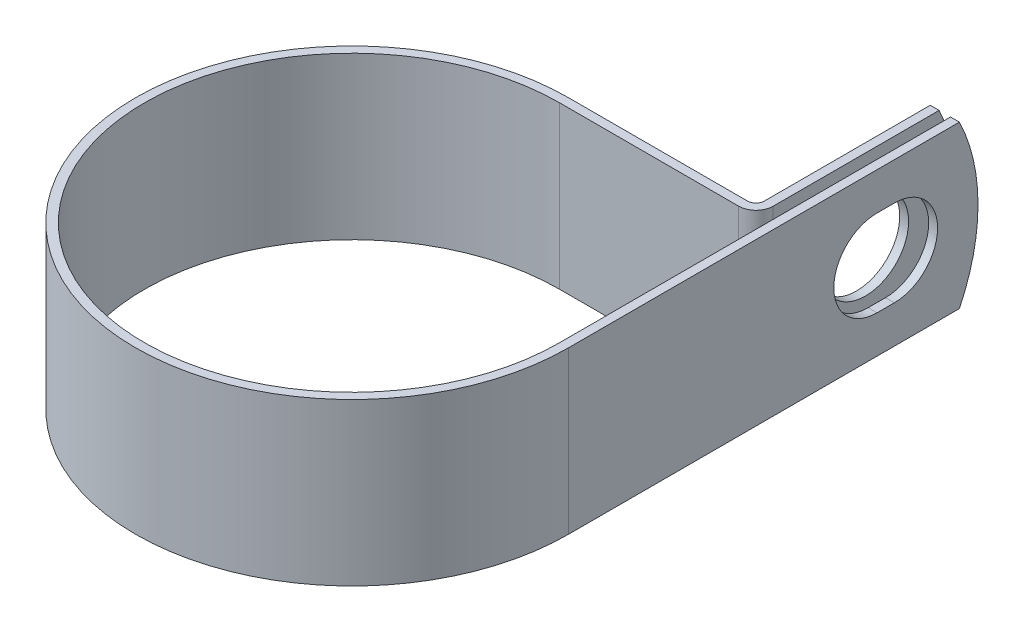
ISO-10303-21;
HEADER;
FILE_DESCRIPTION(('STEP AP214'),'2;1');
FILE_NAME('part.step','',(''),(''),'','','');
FILE_SCHEMA(('AUTOMOTIVE_DESIGN { 1 0 10303 214 1 1 1 1 }'));
ENDSEC;
DATA;
#1=APPLICATION_CONTEXT('core data for automotive mechanical design processes');
#2=APPLICATION_PROTOCOL_DEFINITION('international standard','automotive_design',2000,#1);
#3=PRODUCT_CONTEXT('',#1,'mechanical');
#4=PRODUCT('Part','Part','',(#3));
#5=PRODUCT_RELATED_PRODUCT_CATEGORY('part','',(#4));
#6=PRODUCT_DEFINITION_FORMATION('','',#4);
#7=PRODUCT_DEFINITION_CONTEXT('part definition',#1,'design');
#8=PRODUCT_DEFINITION('design','',#6,#7);
#9=PRODUCT_DEFINITION_SHAPE('','',#8);
#10=(LENGTH_UNIT() NAMED_UNIT(*) SI_UNIT(.MILLI.,.METRE.));
#11=(NAMED_UNIT(*) PLANE_ANGLE_UNIT() SI_UNIT($,.RADIAN.));
#12=(NAMED_UNIT(*) SI_UNIT($,.STERADIAN.) SOLID_ANGLE_UNIT());
#13=UNCERTAINTY_MEASURE_WITH_UNIT(LENGTH_MEASURE(1.E-05),#10,'distance_accuracy_value','');
#14=(GEOMETRIC_REPRESENTATION_CONTEXT(3) GLOBAL_UNCERTAINTY_ASSIGNED_CONTEXT((#13)) GLOBAL_UNIT_ASSIGNED_CONTEXT((#10,
#11,#12)) REPRESENTATION_CONTEXT('',''));
#15=CARTESIAN_POINT('',(0.,0.,0.));
#16=DIRECTION('',(0.,0.,1.));
#17=DIRECTION('',(1.,0.,0.));
#18=AXIS2_PLACEMENT_3D('',#15,#16,#17);
#19=CARTESIAN_POINT('',(28.575,11.1125,0.));
#20=DIRECTION('',(-1.,0.,0.));
#21=DIRECTION('',(0.,0.,1.));
#22=AXIS2_PLACEMENT_3D('',#19,#20,#21);
#23=PLANE('',#22);
#24=DIRECTION('',(0.,0.,-1.));
#25=VECTOR('',#24,1.);
#26=CARTESIAN_POINT('',(28.575,-5.9436,-42.4433999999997));
#27=LINE('',#26,#25);
#28=CARTESIAN_POINT('',(28.575,-5.9436,-42.4433999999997));
#29=VERTEX_POINT('',#28);
#30=CARTESIAN_POINT('',(28.575,-5.9436,-44.8310000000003));
#31=VERTEX_POINT('',#30);
#32=EDGE_CURVE('E236',#29,#31,#27,.T.);
#33=ORIENTED_EDGE('',*,*,#32,.T.);
#34=CARTESIAN_POINT('',(28.575,0.,-44.8309999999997));
#35=DIRECTION('',(-1.,0.,0.));
#36=DIRECTION('',(0.,0.,1.));
#37=AXIS2_PLACEMENT_3D('',#34,#35,#36);
#38=CIRCLE('',#37,5.9436);
#39=CARTESIAN_POINT('',(28.575,5.9436,-44.8310000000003));
#40=VERTEX_POINT('',#39);
#41=EDGE_CURVE('E257',#31,#40,#38,.F.);
#42=ORIENTED_EDGE('',*,*,#41,.T.);
#43=DIRECTION('',(0.,0.,1.));
#44=VECTOR('',#43,1.);
#45=CARTESIAN_POINT('',(28.575,5.9436,-42.4433999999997));
#46=LINE('',#45,#44);
#47=CARTESIAN_POINT('',(28.575,5.9436,-42.4433999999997));
#48=VERTEX_POINT('',#47);
#49=EDGE_CURVE('E253',#40,#48,#46,.T.);
#50=ORIENTED_EDGE('',*,*,#49,.T.);
#51=CARTESIAN_POINT('',(28.575,0.,-42.4433999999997));
#52=DIRECTION('',(-1.,0.,0.));
#53=DIRECTION('',(0.,0.,1.));
#54=AXIS2_PLACEMENT_3D('',#51,#52,#53);
#55=CIRCLE('',#54,5.9436);
#56=EDGE_CURVE('E248',#48,#29,#55,.F.);
#57=ORIENTED_EDGE('',*,*,#56,.T.);
#58=EDGE_LOOP('',(#33,#42,#50,#57));
#59=FACE_BOUND('',#58,.T.);
#60=CARTESIAN_POINT('',(28.575,0.,-30.9372));
#61=DIRECTION('',(-1.,0.,0.));
#62=DIRECTION('',(0.,0.,1.));
#63=AXIS2_PLACEMENT_3D('',#60,#61,#62);
#64=CIRCLE('',#63,25.4);
#65=CARTESIAN_POINT('',(28.575,11.1125,-53.7773476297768));
#66=VERTEX_POINT('',#65);
#67=CARTESIAN_POINT('',(28.575,-11.1125,-53.7773476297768));
#68=VERTEX_POINT('',#67);
#69=EDGE_CURVE('E75',#66,#68,#64,.T.);
#70=ORIENTED_EDGE('',*,*,#69,.T.);
#71=DIRECTION('',(0.,0.,-1.));
#72=VECTOR('',#71,1.);
#73=CARTESIAN_POINT('',(28.575,-11.1125,0.));
#74=LINE('',#73,#72);
#75=CARTESIAN_POINT('',(28.575,-11.1125,0.));
#76=VERTEX_POINT('',#75);
#77=EDGE_CURVE('E271',#76,#68,#74,.T.);
#78=ORIENTED_EDGE('',*,*,#77,.F.);
#79=DIRECTION('',(0.,-1.,0.));
#80=VECTOR('',#79,1.);
#81=CARTESIAN_POINT('',(28.575,11.1125,0.));
#82=LINE('',#81,#80);
#83=CARTESIAN_POINT('',(28.575,11.1125,0.));
#84=VERTEX_POINT('',#83);
#85=EDGE_CURVE('E218',#84,#76,#82,.T.);
#86=ORIENTED_EDGE('',*,*,#85,.F.);
#87=DIRECTION('',(0.,0.,-1.));
#88=VECTOR('',#87,1.);
#89=CARTESIAN_POINT('',(28.575,11.1125,-28.575));
#90=LINE('',#89,#88);
#91=EDGE_CURVE('E273',#84,#66,#90,.T.);
#92=ORIENTED_EDGE('',*,*,#91,.T.);
#93=EDGE_LOOP('',(#70,#78,#86,#92));
#94=FACE_BOUND('',#93,.T.);
#95=ADVANCED_FACE('F54',(#59,#94),#23,.T.);
#96=CARTESIAN_POINT('',(27.0002,11.1125,-56.3372));
#97=DIRECTION('',(1.,0.,0.));
#98=DIRECTION('',(0.,0.,-1.));
#99=AXIS2_PLACEMENT_3D('',#96,#97,#98);
#100=PLANE('',#99);
#101=CARTESIAN_POINT('',(27.0002,0.,-43.6372));
#102=DIRECTION('',(1.,0.,0.));
#103=DIRECTION('',(0.,0.,-1.));
#104=AXIS2_PLACEMENT_3D('',#101,#102,#103);
#105=CIRCLE('',#104,5.9436);
#106=CARTESIAN_POINT('',(27.0002,0.,-49.5808));
#107=VERTEX_POINT('',#106);
#108=EDGE_CURVE('E268',#107,#107,#105,.F.);
#109=ORIENTED_EDGE('',*,*,#108,.T.);
#110=EDGE_LOOP('',(#109));
#111=FACE_BOUND('',#110,.T.);
#112=DIRECTION('',(0.,0.,1.));
#113=VECTOR('',#112,1.);
#114=CARTESIAN_POINT('',(27.0002,-11.1125,-56.3372));
#115=LINE('',#114,#113);
#116=CARTESIAN_POINT('',(27.0002,-11.1125,-53.7773476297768));
#117=VERTEX_POINT('',#116);
#118=CARTESIAN_POINT('',(27.0002,-11.1125,-30.95244));
#119=VERTEX_POINT('',#118);
#120=EDGE_CURVE('E184',#117,#119,#115,.T.);
#121=ORIENTED_EDGE('',*,*,#120,.F.);
#122=CARTESIAN_POINT('',(27.0002,0.,-30.9372));
#123=DIRECTION('',(1.,0.,0.));
#124=DIRECTION('',(0.,0.,-1.));
#125=AXIS2_PLACEMENT_3D('',#122,#123,#124);
#126=CIRCLE('',#125,25.4);
#127=CARTESIAN_POINT('',(27.0002,11.1125,-53.7773476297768));
#128=VERTEX_POINT('',#127);
#129=EDGE_CURVE('E176',#117,#128,#126,.T.);
#130=ORIENTED_EDGE('',*,*,#129,.T.);
#131=DIRECTION('',(0.,0.,1.));
#132=VECTOR('',#131,1.);
#133=CARTESIAN_POINT('',(27.0002,11.1125,-56.3372));
#134=LINE('',#133,#132);
#135=CARTESIAN_POINT('',(27.0002,11.1125,-30.95244));
#136=VERTEX_POINT('',#135);
#137=EDGE_CURVE('E224',#128,#136,#134,.T.);
#138=ORIENTED_EDGE('',*,*,#137,.T.);
#139=DIRECTION('',(0.,-1.,0.));
#140=VECTOR('',#139,1.);
#141=CARTESIAN_POINT('',(27.0002,11.1125,-30.95244));
#142=LINE('',#141,#140);
#143=EDGE_CURVE('E211',#136,#119,#142,.T.);
#144=ORIENTED_EDGE('',*,*,#143,.T.);
#145=EDGE_LOOP('',(#121,#130,#138,#144));
#146=FACE_BOUND('',#145,.T.);
#147=ADVANCED_FACE('F226',(#111,#146),#100,.T.);
#148=CARTESIAN_POINT('',(25.781,11.1125,-56.3372));
#149=DIRECTION('',(1.,0.,0.));
#150=DIRECTION('',(0.,0.,-1.));
#151=AXIS2_PLACEMENT_3D('',#148,#149,#150);
#152=PLANE('',#151);
#153=CARTESIAN_POINT('',(25.781,0.,-43.6372));
#154=DIRECTION('',(-1.,0.,0.));
#155=DIRECTION('',(0.,0.,1.));
#156=AXIS2_PLACEMENT_3D('',#153,#154,#155);
#157=CIRCLE('',#156,5.9436);
#158=CARTESIAN_POINT('',(25.781,0.,-37.6936));
#159=VERTEX_POINT('',#158);
#160=EDGE_CURVE('E265',#159,#159,#157,.T.);
#161=ORIENTED_EDGE('',*,*,#160,.F.);
#162=EDGE_LOOP('',(#161));
#163=FACE_BOUND('',#162,.T.);
#164=CARTESIAN_POINT('',(25.781,0.,-30.9372));
#165=DIRECTION('',(-1.,0.,0.));
#166=DIRECTION('',(0.,0.,1.));
#167=AXIS2_PLACEMENT_3D('',#164,#165,#166);
#168=CIRCLE('',#167,25.4);
#169=CARTESIAN_POINT('',(25.781,11.1125,-53.7773476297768));
#170=VERTEX_POINT('',#169);
#171=CARTESIAN_POINT('',(25.781,-11.1125,-53.7773476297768));
#172=VERTEX_POINT('',#171);
#173=EDGE_CURVE('E67',#170,#172,#168,.T.);
#174=ORIENTED_EDGE('',*,*,#173,.T.);
#175=DIRECTION('',(0.,0.,1.));
#176=VECTOR('',#175,1.);
#177=CARTESIAN_POINT('',(25.781,-11.1125,-56.3372));
#178=LINE('',#177,#176);
#179=CARTESIAN_POINT('',(25.781,-11.1125,-30.95244));
#180=VERTEX_POINT('',#179);
#181=EDGE_CURVE('E167',#172,#180,#178,.T.);
#182=ORIENTED_EDGE('',*,*,#181,.T.);
#183=DIRECTION('',(0.,-1.,0.));
#184=VECTOR('',#183,1.);
#185=CARTESIAN_POINT('',(25.781,11.1125,-30.95244));
#186=LINE('',#185,#184);
#187=CARTESIAN_POINT('',(25.781,11.1125,-30.95244));
#188=VERTEX_POINT('',#187);
#189=EDGE_CURVE('E209',#188,#180,#186,.T.);
#190=ORIENTED_EDGE('',*,*,#189,.F.);
#191=DIRECTION('',(0.,0.,1.));
#192=VECTOR('',#191,1.);
#193=CARTESIAN_POINT('',(25.781,11.1125,-56.3372));
#194=LINE('',#193,#192);
#195=EDGE_CURVE('E169',#170,#188,#194,.T.);
#196=ORIENTED_EDGE('',*,*,#195,.F.);
#197=EDGE_LOOP('',(#174,#182,#190,#196));
#198=FACE_BOUND('',#197,.T.);
#199=ADVANCED_FACE('F164',(#163,#198),#152,.F.);
#200=CARTESIAN_POINT('',(29.7942,11.1125,0.));
#201=DIRECTION('',(-1.,0.,0.));
#202=DIRECTION('',(0.,0.,1.));
#203=AXIS2_PLACEMENT_3D('',#200,#201,#202);
#204=PLANE('',#203);
#205=CARTESIAN_POINT('',(29.7942,0.,-44.8309999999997));
#206=DIRECTION('',(1.,0.,0.));
#207=DIRECTION('',(0.,0.,-1.));
#208=AXIS2_PLACEMENT_3D('',#205,#206,#207);
#209=CIRCLE('',#208,5.9436);
#210=CARTESIAN_POINT('',(29.7942,-5.9436,-44.8310000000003));
#211=VERTEX_POINT('',#210);
#212=CARTESIAN_POINT('',(29.7942,5.9436,-44.8310000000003));
#213=VERTEX_POINT('',#212);
#214=EDGE_CURVE('E237',#211,#213,#209,.T.);
#215=ORIENTED_EDGE('',*,*,#214,.F.);
#216=DIRECTION('',(0.,0.,-1.));
#217=VECTOR('',#216,1.);
#218=CARTESIAN_POINT('',(29.7942,-5.9436,-42.4433999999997));
#219=LINE('',#218,#217);
#220=CARTESIAN_POINT('',(29.7942,-5.9436,-42.4433999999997));
#221=VERTEX_POINT('',#220);
#222=EDGE_CURVE('E240',#221,#211,#219,.T.);
#223=ORIENTED_EDGE('',*,*,#222,.F.);
#224=CARTESIAN_POINT('',(29.7942,0.,-42.4433999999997));
#225=DIRECTION('',(1.,0.,0.));
#226=DIRECTION('',(0.,0.,-1.));
#227=AXIS2_PLACEMENT_3D('',#224,#225,#226);
#228=CIRCLE('',#227,5.9436);
#229=CARTESIAN_POINT('',(29.7942,5.9436,-42.4433999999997));
#230=VERTEX_POINT('',#229);
#231=EDGE_CURVE('E230',#230,#221,#228,.T.);
#232=ORIENTED_EDGE('',*,*,#231,.F.);
#233=DIRECTION('',(0.,0.,1.));
#234=VECTOR('',#233,1.);
#235=CARTESIAN_POINT('',(29.7942,5.9436,-42.4433999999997));
#236=LINE('',#235,#234);
#237=EDGE_CURVE('E234',#213,#230,#236,.T.);
#238=ORIENTED_EDGE('',*,*,#237,.F.);
#239=EDGE_LOOP('',(#215,#223,#232,#238));
#240=FACE_BOUND('',#239,.T.);
#241=DIRECTION('',(0.,0.,-1.));
#242=VECTOR('',#241,1.);
#243=CARTESIAN_POINT('',(29.7942,-11.1125,0.));
#244=LINE('',#243,#242);
#245=CARTESIAN_POINT('',(29.7942,-11.1125,0.));
#246=VERTEX_POINT('',#245);
#247=CARTESIAN_POINT('',(29.7942,-11.1125,-53.7773476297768));
#248=VERTEX_POINT('',#247);
#249=EDGE_CURVE('E195',#246,#248,#244,.T.);
#250=ORIENTED_EDGE('',*,*,#249,.T.);
#251=CARTESIAN_POINT('',(29.7942,0.,-30.9372));
#252=DIRECTION('',(-1.,0.,0.));
#253=DIRECTION('',(0.,0.,1.));
#254=AXIS2_PLACEMENT_3D('',#251,#252,#253);
#255=CIRCLE('',#254,25.4);
#256=CARTESIAN_POINT('',(29.7942,11.1125,-53.7773476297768));
#257=VERTEX_POINT('',#256);
#258=EDGE_CURVE('E170',#257,#248,#255,.T.);
#259=ORIENTED_EDGE('',*,*,#258,.F.);
#260=DIRECTION('',(0.,0.,-1.));
#261=VECTOR('',#260,1.);
#262=CARTESIAN_POINT('',(29.7942,11.1125,-28.575));
#263=LINE('',#262,#261);
#264=CARTESIAN_POINT('',(29.7942,11.1125,0.));
#265=VERTEX_POINT('',#264);
#266=EDGE_CURVE('E198',#265,#257,#263,.T.);
#267=ORIENTED_EDGE('',*,*,#266,.F.);
#268=DIRECTION('',(0.,-1.,0.));
#269=VECTOR('',#268,1.);
#270=CARTESIAN_POINT('',(29.7942,11.1125,0.));
#271=LINE('',#270,#269);
#272=EDGE_CURVE('E199',#265,#246,#271,.T.);
#273=ORIENTED_EDGE('',*,*,#272,.T.);
#274=EDGE_LOOP('',(#250,#259,#267,#273));
#275=FACE_BOUND('',#274,.T.);
#276=ADVANCED_FACE('F321',(#240,#275),#204,.F.);
#277=CARTESIAN_POINT('',(0.,-11.1125,0.));
#278=DIRECTION('',(0.,1.,0.));
#279=DIRECTION('',(1.,0.,0.));
#280=AXIS2_PLACEMENT_3D('',#277,#278,#279);
#281=PLANE('',#280);
#282=DIRECTION('',(-1.,0.,0.));
#283=VECTOR('',#282,1.);
#284=CARTESIAN_POINT('',(29.7942,-11.1125,-53.7773476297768));
#285=LINE('',#284,#283);
#286=EDGE_CURVE('E171',#248,#68,#285,.T.);
#287=ORIENTED_EDGE('',*,*,#286,.F.);
#288=ORIENTED_EDGE('',*,*,#249,.F.);
#289=CARTESIAN_POINT('',(0.,-11.1125,0.));
#290=DIRECTION('',(0.,1.,0.));
#291=DIRECTION('',(1.,0.,0.));
#292=AXIS2_PLACEMENT_3D('',#289,#290,#291);
#293=CIRCLE('',#292,29.7942);
#294=CARTESIAN_POINT('',(0.,-11.1125,-29.7942));
#295=VERTEX_POINT('',#294);
#296=EDGE_CURVE('E193',#295,#246,#293,.T.);
#297=ORIENTED_EDGE('',*,*,#296,.F.);
#298=DIRECTION('',(1.,0.,0.));
#299=VECTOR('',#298,1.);
#300=CARTESIAN_POINT('',(0.,-11.1125,-29.7942));
#301=LINE('',#300,#299);
#302=CARTESIAN_POINT('',(24.62276,-11.1125,-29.7942));
#303=VERTEX_POINT('',#302);
#304=EDGE_CURVE('E186',#303,#295,#301,.F.);
#305=ORIENTED_EDGE('',*,*,#304,.F.);
#306=CARTESIAN_POINT('',(24.62276,-11.1125,-30.95244));
#307=DIRECTION('',(0.,1.,0.));
#308=DIRECTION('',(1.,0.,0.));
#309=AXIS2_PLACEMENT_3D('',#306,#307,#308);
#310=CIRCLE('',#309,1.15824);
#311=EDGE_CURVE('E183',#180,#303,#310,.F.);
#312=ORIENTED_EDGE('',*,*,#311,.F.);
#313=ORIENTED_EDGE('',*,*,#181,.F.);
#314=DIRECTION('',(-1.,0.,0.));
#315=VECTOR('',#314,1.);
#316=CARTESIAN_POINT('',(29.7942,-11.1125,-53.7773476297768));
#317=LINE('',#316,#315);
#318=EDGE_CURVE('E12',#117,#172,#317,.T.);
#319=ORIENTED_EDGE('',*,*,#318,.F.);
#320=ORIENTED_EDGE('',*,*,#120,.T.);
#321=CARTESIAN_POINT('',(24.62276,-11.1125,-30.95244));
#322=DIRECTION('',(0.,-1.,0.));
#323=DIRECTION('',(0.,0.,1.));
#324=AXIS2_PLACEMENT_3D('',#321,#322,#323);
#325=CIRCLE('',#324,2.37744);
#326=CARTESIAN_POINT('',(24.62276,-11.1125,-28.575));
#327=VERTEX_POINT('',#326);
#328=EDGE_CURVE('E188',#119,#327,#325,.T.);
#329=ORIENTED_EDGE('',*,*,#328,.T.);
#330=DIRECTION('',(-1.,0.,0.));
#331=VECTOR('',#330,1.);
#332=CARTESIAN_POINT('',(0.,-11.1125,-28.575));
#333=LINE('',#332,#331);
#334=CARTESIAN_POINT('',(0.,-11.1125,-28.575));
#335=VERTEX_POINT('',#334);
#336=EDGE_CURVE('E298',#327,#335,#333,.T.);
#337=ORIENTED_EDGE('',*,*,#336,.T.);
#338=CARTESIAN_POINT('',(0.,-11.1125,0.));
#339=DIRECTION('',(0.,1.,0.));
#340=DIRECTION('',(0.,0.,1.));
#341=AXIS2_PLACEMENT_3D('',#338,#339,#340);
#342=CIRCLE('',#341,28.575);
#343=EDGE_CURVE('E295',#335,#76,#342,.T.);
#344=ORIENTED_EDGE('',*,*,#343,.T.);
#345=ORIENTED_EDGE('',*,*,#77,.T.);
#346=EDGE_LOOP('',(#287,#288,#297,#305,#312,#313,#319,#320,#329,#337,#344,#345));
#347=FACE_BOUND('',#346,.T.);
#348=ADVANCED_FACE('F181',(#347),#281,.F.);
#349=CARTESIAN_POINT('',(0.,11.1125,0.));
#350=DIRECTION('',(0.,1.,0.));
#351=DIRECTION('',(1.,0.,0.));
#352=AXIS2_PLACEMENT_3D('',#349,#350,#351);
#353=PLANE('',#352);
#354=ORIENTED_EDGE('',*,*,#266,.T.);
#355=DIRECTION('',(-1.,0.,0.));
#356=VECTOR('',#355,1.);
#357=CARTESIAN_POINT('',(29.7942,11.1125,-53.7773476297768));
#358=LINE('',#357,#356);
#359=EDGE_CURVE('E228',#257,#66,#358,.T.);
#360=ORIENTED_EDGE('',*,*,#359,.T.);
#361=ORIENTED_EDGE('',*,*,#91,.F.);
#362=CARTESIAN_POINT('',(0.,11.1125,0.));
#363=DIRECTION('',(0.,1.,0.));
#364=DIRECTION('',(0.,0.,1.));
#365=AXIS2_PLACEMENT_3D('',#362,#363,#364);
#366=CIRCLE('',#365,28.575);
#367=CARTESIAN_POINT('',(0.,11.1125,-28.575));
#368=VERTEX_POINT('',#367);
#369=EDGE_CURVE('E276',#368,#84,#366,.T.);
#370=ORIENTED_EDGE('',*,*,#369,.F.);
#371=DIRECTION('',(-1.,0.,0.));
#372=VECTOR('',#371,1.);
#373=CARTESIAN_POINT('',(0.,11.1125,-28.575));
#374=LINE('',#373,#372);
#375=CARTESIAN_POINT('',(24.62276,11.1125,-28.575));
#376=VERTEX_POINT('',#375);
#377=EDGE_CURVE('E279',#376,#368,#374,.T.);
#378=ORIENTED_EDGE('',*,*,#377,.F.);
#379=CARTESIAN_POINT('',(24.62276,11.1125,-30.95244));
#380=DIRECTION('',(0.,-1.,0.));
#381=DIRECTION('',(0.,0.,1.));
#382=AXIS2_PLACEMENT_3D('',#379,#380,#381);
#383=CIRCLE('',#382,2.37744);
#384=EDGE_CURVE('E282',#136,#376,#383,.T.);
#385=ORIENTED_EDGE('',*,*,#384,.F.);
#386=ORIENTED_EDGE('',*,*,#137,.F.);
#387=DIRECTION('',(-1.,0.,0.));
#388=VECTOR('',#387,1.);
#389=CARTESIAN_POINT('',(29.7942,11.1125,-53.7773476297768));
#390=LINE('',#389,#388);
#391=EDGE_CURVE('E61',#128,#170,#390,.T.);
#392=ORIENTED_EDGE('',*,*,#391,.T.);
#393=ORIENTED_EDGE('',*,*,#195,.T.);
#394=CARTESIAN_POINT('',(24.62276,11.1125,-30.95244));
#395=DIRECTION('',(0.,1.,0.));
#396=DIRECTION('',(1.,0.,0.));
#397=AXIS2_PLACEMENT_3D('',#394,#395,#396);
#398=CIRCLE('',#397,1.15824);
#399=CARTESIAN_POINT('',(24.62276,11.1125,-29.7942));
#400=VERTEX_POINT('',#399);
#401=EDGE_CURVE('E287',#188,#400,#398,.F.);
#402=ORIENTED_EDGE('',*,*,#401,.T.);
#403=DIRECTION('',(1.,0.,0.));
#404=VECTOR('',#403,1.);
#405=CARTESIAN_POINT('',(0.,11.1125,-29.7942));
#406=LINE('',#405,#404);
#407=CARTESIAN_POINT('',(0.,11.1125,-29.7942));
#408=VERTEX_POINT('',#407);
#409=EDGE_CURVE('E289',#400,#408,#406,.F.);
#410=ORIENTED_EDGE('',*,*,#409,.T.);
#411=CARTESIAN_POINT('',(0.,11.1125,0.));
#412=DIRECTION('',(0.,1.,0.));
#413=DIRECTION('',(1.,0.,0.));
#414=AXIS2_PLACEMENT_3D('',#411,#412,#413);
#415=CIRCLE('',#414,29.7942);
#416=EDGE_CURVE('E203',#408,#265,#415,.T.);
#417=ORIENTED_EDGE('',*,*,#416,.T.);
#418=EDGE_LOOP('',(#354,#360,#361,#370,#378,#385,#386,#392,#393,#402,#410,#417));
#419=FACE_BOUND('',#418,.T.);
#420=ADVANCED_FACE('F222',(#419),#353,.T.);
#421=CARTESIAN_POINT('',(0.,11.1125,0.));
#422=DIRECTION('',(0.,-1.,0.));
#423=DIRECTION('',(0.,0.,-1.));
#424=AXIS2_PLACEMENT_3D('',#421,#422,#423);
#425=CYLINDRICAL_SURFACE('',#424,28.575);
#426=ORIENTED_EDGE('',*,*,#343,.F.);
#427=DIRECTION('',(0.,-1.,0.));
#428=VECTOR('',#427,1.);
#429=CARTESIAN_POINT('',(0.,11.1125,-28.575));
#430=LINE('',#429,#428);
#431=EDGE_CURVE('E216',#368,#335,#430,.T.);
#432=ORIENTED_EDGE('',*,*,#431,.F.);
#433=ORIENTED_EDGE('',*,*,#369,.T.);
#434=ORIENTED_EDGE('',*,*,#85,.T.);
#435=EDGE_LOOP('',(#426,#432,#433,#434));
#436=FACE_BOUND('',#435,.T.);
#437=ADVANCED_FACE('F311',(#436),#425,.F.);
#438=CARTESIAN_POINT('',(0.,11.1125,-28.575));
#439=DIRECTION('',(0.,0.,1.));
#440=DIRECTION('',(1.,0.,0.));
#441=AXIS2_PLACEMENT_3D('',#438,#439,#440);
#442=PLANE('',#441);
#443=ORIENTED_EDGE('',*,*,#336,.F.);
#444=DIRECTION('',(0.,-1.,0.));
#445=VECTOR('',#444,1.);
#446=CARTESIAN_POINT('',(24.62276,11.1125,-28.575));
#447=LINE('',#446,#445);
#448=EDGE_CURVE('E214',#376,#327,#447,.T.);
#449=ORIENTED_EDGE('',*,*,#448,.F.);
#450=ORIENTED_EDGE('',*,*,#377,.T.);
#451=ORIENTED_EDGE('',*,*,#431,.T.);
#452=EDGE_LOOP('',(#443,#449,#450,#451));
#453=FACE_BOUND('',#452,.T.);
#454=ADVANCED_FACE('F307',(#453),#442,.T.);
#455=CARTESIAN_POINT('',(24.62276,11.1125,-30.95244));
#456=DIRECTION('',(0.,-1.,0.));
#457=DIRECTION('',(0.,0.,-1.));
#458=AXIS2_PLACEMENT_3D('',#455,#456,#457);
#459=CYLINDRICAL_SURFACE('',#458,2.37744);
#460=ORIENTED_EDGE('',*,*,#328,.F.);
#461=ORIENTED_EDGE('',*,*,#143,.F.);
#462=ORIENTED_EDGE('',*,*,#384,.T.);
#463=ORIENTED_EDGE('',*,*,#448,.T.);
#464=EDGE_LOOP('',(#460,#461,#462,#463));
#465=FACE_BOUND('',#464,.T.);
#466=ADVANCED_FACE('F304',(#465),#459,.T.);
#467=CARTESIAN_POINT('',(24.62276,11.1125,-30.95244));
#468=DIRECTION('',(0.,-1.,0.));
#469=DIRECTION('',(0.,0.,-1.));
#470=AXIS2_PLACEMENT_3D('',#467,#468,#469);
#471=CYLINDRICAL_SURFACE('',#470,1.15824);
#472=ORIENTED_EDGE('',*,*,#311,.T.);
#473=DIRECTION('',(0.,-1.,0.));
#474=VECTOR('',#473,1.);
#475=CARTESIAN_POINT('',(24.62276,11.1125,-29.7942));
#476=LINE('',#475,#474);
#477=EDGE_CURVE('E206',#400,#303,#476,.T.);
#478=ORIENTED_EDGE('',*,*,#477,.F.);
#479=ORIENTED_EDGE('',*,*,#401,.F.);
#480=ORIENTED_EDGE('',*,*,#189,.T.);
#481=EDGE_LOOP('',(#472,#478,#479,#480));
#482=FACE_BOUND('',#481,.T.);
#483=ADVANCED_FACE('F334',(#482),#471,.F.);
#484=CARTESIAN_POINT('',(0.,11.1125,-29.7942));
#485=DIRECTION('',(0.,0.,1.));
#486=DIRECTION('',(1.,0.,0.));
#487=AXIS2_PLACEMENT_3D('',#484,#485,#486);
#488=PLANE('',#487);
#489=ORIENTED_EDGE('',*,*,#304,.T.);
#490=DIRECTION('',(0.,-1.,0.));
#491=VECTOR('',#490,1.);
#492=CARTESIAN_POINT('',(0.,11.1125,-29.7942));
#493=LINE('',#492,#491);
#494=EDGE_CURVE('E202',#408,#295,#493,.T.);
#495=ORIENTED_EDGE('',*,*,#494,.F.);
#496=ORIENTED_EDGE('',*,*,#409,.F.);
#497=ORIENTED_EDGE('',*,*,#477,.T.);
#498=EDGE_LOOP('',(#489,#495,#496,#497));
#499=FACE_BOUND('',#498,.T.);
#500=ADVANCED_FACE('F330',(#499),#488,.F.);
#501=CARTESIAN_POINT('',(0.,11.1125,0.));
#502=DIRECTION('',(0.,-1.,0.));
#503=DIRECTION('',(0.,0.,-1.));
#504=AXIS2_PLACEMENT_3D('',#501,#502,#503);
#505=CYLINDRICAL_SURFACE('',#504,29.7942);
#506=ORIENTED_EDGE('',*,*,#296,.T.);
#507=ORIENTED_EDGE('',*,*,#272,.F.);
#508=ORIENTED_EDGE('',*,*,#416,.F.);
#509=ORIENTED_EDGE('',*,*,#494,.T.);
#510=EDGE_LOOP('',(#506,#507,#508,#509));
#511=FACE_BOUND('',#510,.T.);
#512=ADVANCED_FACE('F327',(#511),#505,.T.);
#513=CARTESIAN_POINT('',(43.8112394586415,0.,-43.6372));
#514=DIRECTION('',(-1.,0.,0.));
#515=DIRECTION('',(0.,0.,1.));
#516=AXIS2_PLACEMENT_3D('',#513,#514,#515);
#517=CYLINDRICAL_SURFACE('',#516,5.9436);
#518=ORIENTED_EDGE('',*,*,#160,.T.);
#519=EDGE_LOOP('',(#518));
#520=FACE_BOUND('',#519,.T.);
#521=ORIENTED_EDGE('',*,*,#108,.F.);
#522=EDGE_LOOP('',(#521));
#523=FACE_BOUND('',#522,.T.);
#524=ADVANCED_FACE('F379',(#520,#523),#517,.F.);
#525=CARTESIAN_POINT('',(9.99879374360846,-5.9436,-42.4433999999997));
#526=DIRECTION('',(0.,-1.,0.));
#527=DIRECTION('',(0.,0.,-1.));
#528=AXIS2_PLACEMENT_3D('',#525,#526,#527);
#529=PLANE('',#528);
#530=DIRECTION('',(1.,0.,0.));
#531=VECTOR('',#530,1.);
#532=CARTESIAN_POINT('',(9.99879374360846,-5.9436,-42.4433999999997));
#533=LINE('',#532,#531);
#534=EDGE_CURVE('E251',#29,#221,#533,.T.);
#535=ORIENTED_EDGE('',*,*,#534,.T.);
#536=ORIENTED_EDGE('',*,*,#222,.T.);
#537=DIRECTION('',(1.,0.,0.));
#538=VECTOR('',#537,1.);
#539=CARTESIAN_POINT('',(9.99879374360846,-5.9436,-44.8310000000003));
#540=LINE('',#539,#538);
#541=EDGE_CURVE('E247',#31,#211,#540,.T.);
#542=ORIENTED_EDGE('',*,*,#541,.F.);
#543=ORIENTED_EDGE('',*,*,#32,.F.);
#544=EDGE_LOOP('',(#535,#536,#542,#543));
#545=FACE_BOUND('',#544,.T.);
#546=ADVANCED_FACE('F354',(#545),#529,.F.);
#547=CARTESIAN_POINT('',(9.99879374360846,0.,-44.8309999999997));
#548=DIRECTION('',(1.,0.,0.));
#549=DIRECTION('',(0.,0.,-1.));
#550=AXIS2_PLACEMENT_3D('',#547,#548,#549);
#551=CYLINDRICAL_SURFACE('',#550,5.9436);
#552=ORIENTED_EDGE('',*,*,#541,.T.);
#553=ORIENTED_EDGE('',*,*,#214,.T.);
#554=DIRECTION('',(1.,0.,0.));
#555=VECTOR('',#554,1.);
#556=CARTESIAN_POINT('',(9.99879374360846,5.9436,-44.8310000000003));
#557=LINE('',#556,#555);
#558=EDGE_CURVE('E256',#40,#213,#557,.T.);
#559=ORIENTED_EDGE('',*,*,#558,.F.);
#560=ORIENTED_EDGE('',*,*,#41,.F.);
#561=EDGE_LOOP('',(#552,#553,#559,#560));
#562=FACE_BOUND('',#561,.T.);
#563=ADVANCED_FACE('F358',(#562),#551,.F.);
#564=CARTESIAN_POINT('',(9.99879374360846,5.9436,-42.4433999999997));
#565=DIRECTION('',(0.,1.,0.));
#566=DIRECTION('',(0.,0.,1.));
#567=AXIS2_PLACEMENT_3D('',#564,#565,#566);
#568=PLANE('',#567);
#569=ORIENTED_EDGE('',*,*,#558,.T.);
#570=ORIENTED_EDGE('',*,*,#237,.T.);
#571=DIRECTION('',(1.,0.,0.));
#572=VECTOR('',#571,1.);
#573=CARTESIAN_POINT('',(9.99879374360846,5.9436,-42.4433999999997));
#574=LINE('',#573,#572);
#575=EDGE_CURVE('E252',#48,#230,#574,.T.);
#576=ORIENTED_EDGE('',*,*,#575,.F.);
#577=ORIENTED_EDGE('',*,*,#49,.F.);
#578=EDGE_LOOP('',(#569,#570,#576,#577));
#579=FACE_BOUND('',#578,.T.);
#580=ADVANCED_FACE('F362',(#579),#568,.F.);
#581=CARTESIAN_POINT('',(9.99879374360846,0.,-42.4433999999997));
#582=DIRECTION('',(1.,0.,0.));
#583=DIRECTION('',(0.,0.,-1.));
#584=AXIS2_PLACEMENT_3D('',#581,#582,#583);
#585=CYLINDRICAL_SURFACE('',#584,5.9436);
#586=ORIENTED_EDGE('',*,*,#575,.T.);
#587=ORIENTED_EDGE('',*,*,#231,.T.);
#588=ORIENTED_EDGE('',*,*,#534,.F.);
#589=ORIENTED_EDGE('',*,*,#56,.F.);
#590=EDGE_LOOP('',(#586,#587,#588,#589));
#591=FACE_BOUND('',#590,.T.);
#592=ADVANCED_FACE('F366',(#591),#585,.F.);
#593=CARTESIAN_POINT('',(29.7942,0.,-30.9372));
#594=DIRECTION('',(-1.,0.,0.));
#595=DIRECTION('',(0.,0.,1.));
#596=AXIS2_PLACEMENT_3D('',#593,#594,#595);
#597=CYLINDRICAL_SURFACE('',#596,25.4);
#598=ORIENTED_EDGE('',*,*,#129,.F.);
#599=ORIENTED_EDGE('',*,*,#318,.T.);
#600=ORIENTED_EDGE('',*,*,#173,.F.);
#601=ORIENTED_EDGE('',*,*,#391,.F.);
#602=EDGE_LOOP('',(#598,#599,#600,#601));
#603=FACE_BOUND('',#602,.T.);
#604=ADVANCED_FACE('F174',(#603),#597,.T.);
#605=ORIENTED_EDGE('',*,*,#359,.F.);
#606=ORIENTED_EDGE('',*,*,#258,.T.);
#607=ORIENTED_EDGE('',*,*,#286,.T.);
#608=ORIENTED_EDGE('',*,*,#69,.F.);
#609=EDGE_LOOP('',(#605,#606,#607,#608));
#610=FACE_BOUND('',#609,.T.);
#611=ADVANCED_FACE('F316',(#610),#597,.T.);
#612=CLOSED_SHELL('',(#95,#147,#199,#276,#348,#420,#437,#454,#466,#483,#500,#512,#524,#546,#563,
#580,#592,#604,#611));
#613=MANIFOLD_SOLID_BREP('B2',#612);
#614=ADVANCED_BREP_SHAPE_REPRESENTATION('',(#18,#613),#14);
#615=SHAPE_DEFINITION_REPRESENTATION(#9,#614);
ENDSEC;
END-ISO-10303-21;
